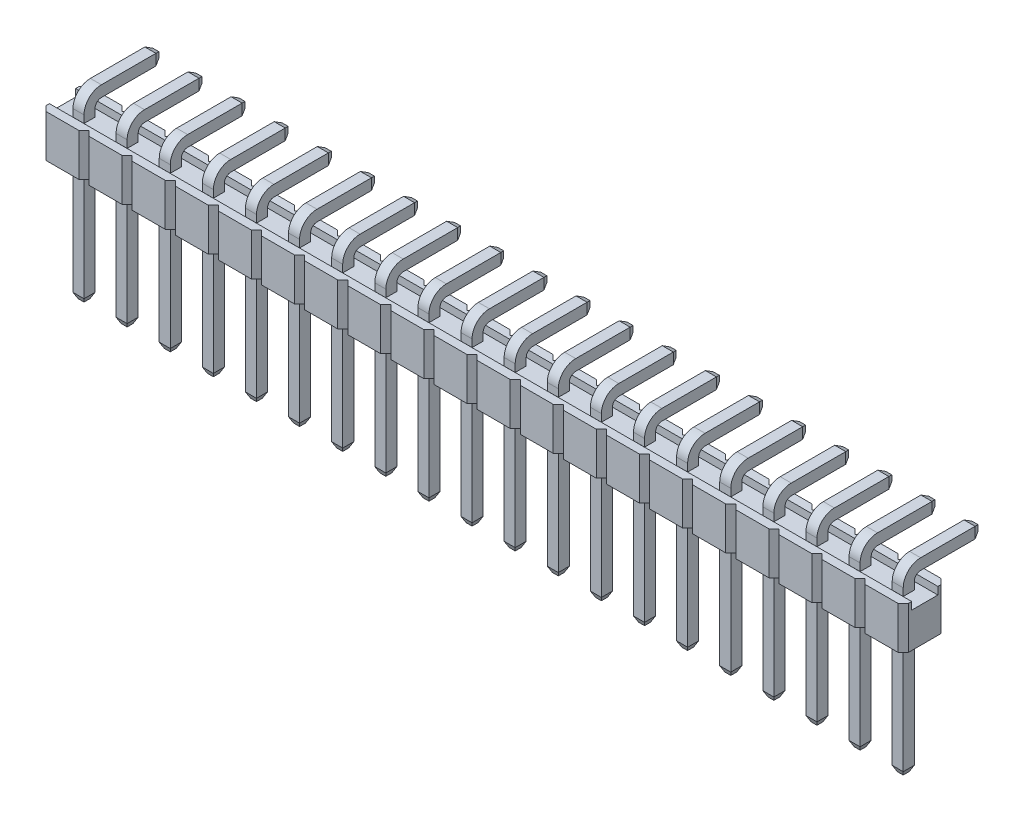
from build123d import *
from OCP.BRepFilletAPI import BRepFilletAPI_MakeChamfer

# Parameters (mm, degrees)
BASE_DEPTH                  = 2.5
LPATTERN1_COUNT             = 20
LPATTERN1_PITCH             = 2.54
CUT_DEPTH                   = 50.609311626
CUT_DEPTH_BACK              = 50.609311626
SKETCH2_W                   = 1.54
SKETCH2_H                   = 0.44
PIN_DEPTH                   = 0.325
CHAMFER1_SIZE               = 0.15
CHAMFER1_SIZE2              = 0.321676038
LPATTERN2_COUNT             = 20
LPATTERN2_PITCH             = 2.54
CHAMFER1_OF_LPATTERN2_SIZE  = 0.15
CHAMFER1_OF_LPATTERN2_SIZE2 = 0.321676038


with BuildPart() as part:
    # Sketch1 → Base (new body)
    with BuildSketch(Plane(origin=(0, 0, 0), x_dir=(1, 0, 0), z_dir=(0, 1, 0))):
        Polygon((-1.27, 0.97), (-0.97, 1.27), (0.97, 1.27), (1.27, 0.97), (1.27, -0.97), (0.97, -1.27), (-0.97, -1.27), (-1.27, -0.97), align=None)
    base = extrude(amount=-BASE_DEPTH)

    # LPattern1: Base ×20
    with Locations(*[(-i * LPATTERN1_PITCH, 0, 0) for i in range(1, LPATTERN1_COUNT)]):
        add(base)

    # Sketch2 → Cut (cut, two sides: drawn at the far end of the back side and taken through both)
    with BuildSketch(Plane(origin=(0, 0, 0), x_dir=(0, 0, -1), z_dir=(1, 0, 0)).offset(-CUT_DEPTH_BACK)):
        with Locations((0, -0.22)):
            Rectangle(SKETCH2_W, SKETCH2_H)
    extrude(amount=CUT_DEPTH + CUT_DEPTH_BACK, mode=Mode.SUBTRACT)

    # Sketch3 → Pin (add, symmetric)
    with BuildSketch(Plane(origin=(0, 0, 0), x_dir=(0, 0, -1), z_dir=(1, 0, 0))):
        with BuildLine():
            Line((0.325, -9.7), (0.325, 0))
            ThreePointArc((0.325, 0), (0.434834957, 0.265165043), (0.7, 0.375))
            Line((0.7, 0.375), (4.23, 0.375))
            Line((4.23, 0.375), (4.23, 1.025))
            Line((4.23, 1.025), (0.7, 1.025))
            ThreePointArc((0.7, 1.025), (-0.024784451, 0.724784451), (-0.325, 0))
            Line((-0.325, 0), (-0.325, -9.7))
            Line((-0.325, -9.7), (0.325, -9.7))
        make_face()
    pin = extrude(amount=PIN_DEPTH, both=True)

    # Chamfer1: one chamfer whose edges measure the first distance from different faces: ONE call of the kernel's chamfer builder (chamfer() names one face for all edges)
    chamfer1_edges_1 = [part.edges().sort_by_distance(p)[0] for p in [
        (-0.325, 0.7, -4.23),
        (0.325, 0.7, -4.23),
        (0, 0.375, -4.23),
        (0, 1.025, -4.23),
    ]]
    chamfer1_side_1 = [part.faces().sort_by_distance(p)[0] for p in [
        (0, 0.7, -4.23),
    ]]
    chamfer1_edges_2 = [part.edges().sort_by_distance(p)[0] for p in [
        (0.325, -9.7, 0),
        (0, -9.7, 0.325),
        (0, -9.7, -0.325),
        (-0.325, -9.7, 0),
    ]]
    chamfer1_side_2 = [part.faces().sort_by_distance(p)[0] for p in [
        (0, -9.7, 0),
    ]]
    chamfer1 = BRepFilletAPI_MakeChamfer(part.part.solid().wrapped)
    for e in chamfer1_edges_1:
        chamfer1.Add(CHAMFER1_SIZE, CHAMFER1_SIZE2, e.wrapped, chamfer1_side_1[0].wrapped)  # the first distance lies on this face
    for e in chamfer1_edges_2:
        chamfer1.Add(CHAMFER1_SIZE, CHAMFER1_SIZE2, e.wrapped, chamfer1_side_2[0].wrapped)  # the first distance lies on this face
    add(Compound.cast(chamfer1.Shape()), mode=Mode.REPLACE)

    # LPattern2: Pin ×20
    with Locations(*[(-i * LPATTERN2_PITCH, 0, 0) for i in range(1, LPATTERN2_COUNT)]):
        add(pin)

    # Chamfer1 of LPattern2: one chamfer whose edges measure the first distance from different faces: ONE call of the kernel's chamfer builder (chamfer() names one face for all edges)
    chamfer1_of_lpattern2_edges_1 = [part.edges().sort_by_distance(p)[0] for p in [
        (-2.865, 0.7, -4.23),
        (-2.215, 0.7, -4.23),
        (-2.54, 0.375, -4.23),
        (-2.54, 1.025, -4.23),
    ]]
    chamfer1_of_lpattern2_side_1 = [part.faces().sort_by_distance(p)[0] for p in [
        (-2.54, 0.7, -4.23),
    ]]
    chamfer1_of_lpattern2_edges_2 = [part.edges().sort_by_distance(p)[0] for p in [
        (-2.215, -9.7, 0),
        (-2.54, -9.7, 0.325),
        (-2.54, -9.7, -0.325),
        (-2.865, -9.7, 0),
    ]]
    chamfer1_of_lpattern2_side_2 = [part.faces().sort_by_distance(p)[0] for p in [
        (-2.54, -9.7, 0),
    ]]
    chamfer1_of_lpattern2_edges_3 = [part.edges().sort_by_distance(p)[0] for p in [
        (-5.405, 0.7, -4.23),
        (-4.755, 0.7, -4.23),
        (-5.08, 0.375, -4.23),
        (-5.08, 1.025, -4.23),
    ]]
    chamfer1_of_lpattern2_side_3 = [part.faces().sort_by_distance(p)[0] for p in [
        (-5.08, 0.7, -4.23),
    ]]
    chamfer1_of_lpattern2_edges_4 = [part.edges().sort_by_distance(p)[0] for p in [
        (-4.755, -9.7, 0),
        (-5.08, -9.7, 0.325),
        (-5.08, -9.7, -0.325),
        (-5.405, -9.7, 0),
    ]]
    chamfer1_of_lpattern2_side_4 = [part.faces().sort_by_distance(p)[0] for p in [
        (-5.08, -9.7, 0),
    ]]
    chamfer1_of_lpattern2_edges_5 = [part.edges().sort_by_distance(p)[0] for p in [
        (-7.945, 0.7, -4.23),
        (-7.295, 0.7, -4.23),
        (-7.62, 0.375, -4.23),
        (-7.62, 1.025, -4.23),
    ]]
    chamfer1_of_lpattern2_side_5 = [part.faces().sort_by_distance(p)[0] for p in [
        (-7.62, 0.7, -4.23),
    ]]
    chamfer1_of_lpattern2_edges_6 = [part.edges().sort_by_distance(p)[0] for p in [
        (-7.295, -9.7, 0),
        (-7.62, -9.7, 0.325),
        (-7.62, -9.7, -0.325),
        (-7.945, -9.7, 0),
    ]]
    chamfer1_of_lpattern2_side_6 = [part.faces().sort_by_distance(p)[0] for p in [
        (-7.62, -9.7, 0),
    ]]
    chamfer1_of_lpattern2_edges_7 = [part.edges().sort_by_distance(p)[0] for p in [
        (-10.485, 0.7, -4.23),
        (-9.835, 0.7, -4.23),
        (-10.16, 0.375, -4.23),
        (-10.16, 1.025, -4.23),
    ]]
    chamfer1_of_lpattern2_side_7 = [part.faces().sort_by_distance(p)[0] for p in [
        (-10.16, 0.7, -4.23),
    ]]
    chamfer1_of_lpattern2_edges_8 = [part.edges().sort_by_distance(p)[0] for p in [
        (-9.835, -9.7, 0),
        (-10.16, -9.7, 0.325),
        (-10.16, -9.7, -0.325),
        (-10.485, -9.7, 0),
    ]]
    chamfer1_of_lpattern2_side_8 = [part.faces().sort_by_distance(p)[0] for p in [
        (-10.16, -9.7, 0),
    ]]
    chamfer1_of_lpattern2_edges_9 = [part.edges().sort_by_distance(p)[0] for p in [
        (-13.025, 0.7, -4.23),
        (-12.375, 0.7, -4.23),
        (-12.7, 0.375, -4.23),
        (-12.7, 1.025, -4.23),
    ]]
    chamfer1_of_lpattern2_side_9 = [part.faces().sort_by_distance(p)[0] for p in [
        (-12.7, 0.7, -4.23),
    ]]
    chamfer1_of_lpattern2_edges_10 = [part.edges().sort_by_distance(p)[0] for p in [
        (-12.375, -9.7, 0),
        (-12.7, -9.7, 0.325),
        (-12.7, -9.7, -0.325),
        (-13.025, -9.7, 0),
    ]]
    chamfer1_of_lpattern2_side_10 = [part.faces().sort_by_distance(p)[0] for p in [
        (-12.7, -9.7, 0),
    ]]
    chamfer1_of_lpattern2_edges_11 = [part.edges().sort_by_distance(p)[0] for p in [
        (-15.565, 0.7, -4.23),
        (-14.915, 0.7, -4.23),
        (-15.24, 0.375, -4.23),
        (-15.24, 1.025, -4.23),
    ]]
    chamfer1_of_lpattern2_side_11 = [part.faces().sort_by_distance(p)[0] for p in [
        (-15.24, 0.7, -4.23),
    ]]
    chamfer1_of_lpattern2_edges_12 = [part.edges().sort_by_distance(p)[0] for p in [
        (-14.915, -9.7, 0),
        (-15.24, -9.7, 0.325),
        (-15.24, -9.7, -0.325),
        (-15.565, -9.7, 0),
    ]]
    chamfer1_of_lpattern2_side_12 = [part.faces().sort_by_distance(p)[0] for p in [
        (-15.24, -9.7, 0),
    ]]
    chamfer1_of_lpattern2_edges_13 = [part.edges().sort_by_distance(p)[0] for p in [
        (-18.105, 0.7, -4.23),
        (-17.455, 0.7, -4.23),
        (-17.78, 0.375, -4.23),
        (-17.78, 1.025, -4.23),
    ]]
    chamfer1_of_lpattern2_side_13 = [part.faces().sort_by_distance(p)[0] for p in [
        (-17.78, 0.7, -4.23),
    ]]
    chamfer1_of_lpattern2_edges_14 = [part.edges().sort_by_distance(p)[0] for p in [
        (-17.455, -9.7, 0),
        (-17.78, -9.7, 0.325),
        (-17.78, -9.7, -0.325),
        (-18.105, -9.7, 0),
    ]]
    chamfer1_of_lpattern2_side_14 = [part.faces().sort_by_distance(p)[0] for p in [
        (-17.78, -9.7, 0),
    ]]
    chamfer1_of_lpattern2_edges_15 = [part.edges().sort_by_distance(p)[0] for p in [
        (-20.645, 0.7, -4.23),
        (-19.995, 0.7, -4.23),
        (-20.32, 0.375, -4.23),
        (-20.32, 1.025, -4.23),
    ]]
    chamfer1_of_lpattern2_side_15 = [part.faces().sort_by_distance(p)[0] for p in [
        (-20.32, 0.7, -4.23),
    ]]
    chamfer1_of_lpattern2_edges_16 = [part.edges().sort_by_distance(p)[0] for p in [
        (-19.995, -9.7, 0),
        (-20.32, -9.7, 0.325),
        (-20.32, -9.7, -0.325),
        (-20.645, -9.7, 0),
    ]]
    chamfer1_of_lpattern2_side_16 = [part.faces().sort_by_distance(p)[0] for p in [
        (-20.32, -9.7, 0),
    ]]
    chamfer1_of_lpattern2_edges_17 = [part.edges().sort_by_distance(p)[0] for p in [
        (-23.185, 0.7, -4.23),
        (-22.535, 0.7, -4.23),
        (-22.86, 0.375, -4.23),
        (-22.86, 1.025, -4.23),
    ]]
    chamfer1_of_lpattern2_side_17 = [part.faces().sort_by_distance(p)[0] for p in [
        (-22.86, 0.7, -4.23),
    ]]
    chamfer1_of_lpattern2_edges_18 = [part.edges().sort_by_distance(p)[0] for p in [
        (-22.535, -9.7, 0),
        (-22.86, -9.7, 0.325),
        (-22.86, -9.7, -0.325),
        (-23.185, -9.7, 0),
    ]]
    chamfer1_of_lpattern2_side_18 = [part.faces().sort_by_distance(p)[0] for p in [
        (-22.86, -9.7, 0),
    ]]
    chamfer1_of_lpattern2_edges_19 = [part.edges().sort_by_distance(p)[0] for p in [
        (-25.725, 0.7, -4.23),
        (-25.075, 0.7, -4.23),
        (-25.4, 0.375, -4.23),
        (-25.4, 1.025, -4.23),
    ]]
    chamfer1_of_lpattern2_side_19 = [part.faces().sort_by_distance(p)[0] for p in [
        (-25.4, 0.7, -4.23),
    ]]
    chamfer1_of_lpattern2_edges_20 = [part.edges().sort_by_distance(p)[0] for p in [
        (-25.075, -9.7, 0),
        (-25.4, -9.7, 0.325),
        (-25.4, -9.7, -0.325),
        (-25.725, -9.7, 0),
    ]]
    chamfer1_of_lpattern2_side_20 = [part.faces().sort_by_distance(p)[0] for p in [
        (-25.4, -9.7, 0),
    ]]
    chamfer1_of_lpattern2_edges_21 = [part.edges().sort_by_distance(p)[0] for p in [
        (-28.265, 0.7, -4.23),
        (-27.615, 0.7, -4.23),
        (-27.94, 0.375, -4.23),
        (-27.94, 1.025, -4.23),
    ]]
    chamfer1_of_lpattern2_side_21 = [part.faces().sort_by_distance(p)[0] for p in [
        (-27.94, 0.7, -4.23),
    ]]
    chamfer1_of_lpattern2_edges_22 = [part.edges().sort_by_distance(p)[0] for p in [
        (-27.615, -9.7, 0),
        (-27.94, -9.7, 0.325),
        (-27.94, -9.7, -0.325),
        (-28.265, -9.7, 0),
    ]]
    chamfer1_of_lpattern2_side_22 = [part.faces().sort_by_distance(p)[0] for p in [
        (-27.94, -9.7, 0),
    ]]
    chamfer1_of_lpattern2_edges_23 = [part.edges().sort_by_distance(p)[0] for p in [
        (-30.805, 0.7, -4.23),
        (-30.155, 0.7, -4.23),
        (-30.48, 0.375, -4.23),
        (-30.48, 1.025, -4.23),
    ]]
    chamfer1_of_lpattern2_side_23 = [part.faces().sort_by_distance(p)[0] for p in [
        (-30.48, 0.7, -4.23),
    ]]
    chamfer1_of_lpattern2_edges_24 = [part.edges().sort_by_distance(p)[0] for p in [
        (-30.155, -9.7, 0),
        (-30.48, -9.7, 0.325),
        (-30.48, -9.7, -0.325),
        (-30.805, -9.7, 0),
    ]]
    chamfer1_of_lpattern2_side_24 = [part.faces().sort_by_distance(p)[0] for p in [
        (-30.48, -9.7, 0),
    ]]
    chamfer1_of_lpattern2_edges_25 = [part.edges().sort_by_distance(p)[0] for p in [
        (-33.345, 0.7, -4.23),
        (-32.695, 0.7, -4.23),
        (-33.02, 0.375, -4.23),
        (-33.02, 1.025, -4.23),
    ]]
    chamfer1_of_lpattern2_side_25 = [part.faces().sort_by_distance(p)[0] for p in [
        (-33.02, 0.7, -4.23),
    ]]
    chamfer1_of_lpattern2_edges_26 = [part.edges().sort_by_distance(p)[0] for p in [
        (-32.695, -9.7, 0),
        (-33.02, -9.7, 0.325),
        (-33.02, -9.7, -0.325),
        (-33.345, -9.7, 0),
    ]]
    chamfer1_of_lpattern2_side_26 = [part.faces().sort_by_distance(p)[0] for p in [
        (-33.02, -9.7, 0),
    ]]
    chamfer1_of_lpattern2_edges_27 = [part.edges().sort_by_distance(p)[0] for p in [
        (-35.885, 0.7, -4.23),
        (-35.235, 0.7, -4.23),
        (-35.56, 0.375, -4.23),
        (-35.56, 1.025, -4.23),
    ]]
    chamfer1_of_lpattern2_side_27 = [part.faces().sort_by_distance(p)[0] for p in [
        (-35.56, 0.7, -4.23),
    ]]
    chamfer1_of_lpattern2_edges_28 = [part.edges().sort_by_distance(p)[0] for p in [
        (-35.235, -9.7, 0),
        (-35.56, -9.7, 0.325),
        (-35.56, -9.7, -0.325),
        (-35.885, -9.7, 0),
    ]]
    chamfer1_of_lpattern2_side_28 = [part.faces().sort_by_distance(p)[0] for p in [
        (-35.56, -9.7, 0),
    ]]
    chamfer1_of_lpattern2_edges_29 = [part.edges().sort_by_distance(p)[0] for p in [
        (-38.425, 0.7, -4.23),
        (-37.775, 0.7, -4.23),
        (-38.1, 0.375, -4.23),
        (-38.1, 1.025, -4.23),
    ]]
    chamfer1_of_lpattern2_side_29 = [part.faces().sort_by_distance(p)[0] for p in [
        (-38.1, 0.7, -4.23),
    ]]
    chamfer1_of_lpattern2_edges_30 = [part.edges().sort_by_distance(p)[0] for p in [
        (-37.775, -9.7, 0),
        (-38.1, -9.7, 0.325),
        (-38.1, -9.7, -0.325),
        (-38.425, -9.7, 0),
    ]]
    chamfer1_of_lpattern2_side_30 = [part.faces().sort_by_distance(p)[0] for p in [
        (-38.1, -9.7, 0),
    ]]
    chamfer1_of_lpattern2_edges_31 = [part.edges().sort_by_distance(p)[0] for p in [
        (-40.965, 0.7, -4.23),
        (-40.315, 0.7, -4.23),
        (-40.64, 0.375, -4.23),
        (-40.64, 1.025, -4.23),
    ]]
    chamfer1_of_lpattern2_side_31 = [part.faces().sort_by_distance(p)[0] for p in [
        (-40.64, 0.7, -4.23),
    ]]
    chamfer1_of_lpattern2_edges_32 = [part.edges().sort_by_distance(p)[0] for p in [
        (-40.315, -9.7, 0),
        (-40.64, -9.7, 0.325),
        (-40.64, -9.7, -0.325),
        (-40.965, -9.7, 0),
    ]]
    chamfer1_of_lpattern2_side_32 = [part.faces().sort_by_distance(p)[0] for p in [
        (-40.64, -9.7, 0),
    ]]
    chamfer1_of_lpattern2_edges_33 = [part.edges().sort_by_distance(p)[0] for p in [
        (-43.505, 0.7, -4.23),
        (-42.855, 0.7, -4.23),
        (-43.18, 0.375, -4.23),
        (-43.18, 1.025, -4.23),
    ]]
    chamfer1_of_lpattern2_side_33 = [part.faces().sort_by_distance(p)[0] for p in [
        (-43.18, 0.7, -4.23),
    ]]
    chamfer1_of_lpattern2_edges_34 = [part.edges().sort_by_distance(p)[0] for p in [
        (-42.855, -9.7, 0),
        (-43.18, -9.7, 0.325),
        (-43.18, -9.7, -0.325),
        (-43.505, -9.7, 0),
    ]]
    chamfer1_of_lpattern2_side_34 = [part.faces().sort_by_distance(p)[0] for p in [
        (-43.18, -9.7, 0),
    ]]
    chamfer1_of_lpattern2_edges_35 = [part.edges().sort_by_distance(p)[0] for p in [
        (-46.045, 0.7, -4.23),
        (-45.395, 0.7, -4.23),
        (-45.72, 0.375, -4.23),
        (-45.72, 1.025, -4.23),
    ]]
    chamfer1_of_lpattern2_side_35 = [part.faces().sort_by_distance(p)[0] for p in [
        (-45.72, 0.7, -4.23),
    ]]
    chamfer1_of_lpattern2_edges_36 = [part.edges().sort_by_distance(p)[0] for p in [
        (-45.395, -9.7, 0),
        (-45.72, -9.7, 0.325),
        (-45.72, -9.7, -0.325),
        (-46.045, -9.7, 0),
    ]]
    chamfer1_of_lpattern2_side_36 = [part.faces().sort_by_distance(p)[0] for p in [
        (-45.72, -9.7, 0),
    ]]
    chamfer1_of_lpattern2_edges_37 = [part.edges().sort_by_distance(p)[0] for p in [
        (-48.585, 0.7, -4.23),
        (-47.935, 0.7, -4.23),
        (-48.26, 0.375, -4.23),
        (-48.26, 1.025, -4.23),
    ]]
    chamfer1_of_lpattern2_side_37 = [part.faces().sort_by_distance(p)[0] for p in [
        (-48.26, 0.7, -4.23),
    ]]
    chamfer1_of_lpattern2_edges_38 = [part.edges().sort_by_distance(p)[0] for p in [
        (-47.935, -9.7, 0),
        (-48.26, -9.7, 0.325),
        (-48.26, -9.7, -0.325),
        (-48.585, -9.7, 0),
    ]]
    chamfer1_of_lpattern2_side_38 = [part.faces().sort_by_distance(p)[0] for p in [
        (-48.26, -9.7, 0),
    ]]
    chamfer1_of_lpattern2 = BRepFilletAPI_MakeChamfer(part.part.solid().wrapped)
    for e in chamfer1_of_lpattern2_edges_1:
        chamfer1_of_lpattern2.Add(CHAMFER1_OF_LPATTERN2_SIZE, CHAMFER1_OF_LPATTERN2_SIZE2, e.wrapped, chamfer1_of_lpattern2_side_1[0].wrapped)  # the first distance lies on this face
    for e in chamfer1_of_lpattern2_edges_2:
        chamfer1_of_lpattern2.Add(CHAMFER1_OF_LPATTERN2_SIZE, CHAMFER1_OF_LPATTERN2_SIZE2, e.wrapped, chamfer1_of_lpattern2_side_2[0].wrapped)  # the first distance lies on this face
    for e in chamfer1_of_lpattern2_edges_3:
        chamfer1_of_lpattern2.Add(CHAMFER1_OF_LPATTERN2_SIZE, CHAMFER1_OF_LPATTERN2_SIZE2, e.wrapped, chamfer1_of_lpattern2_side_3[0].wrapped)  # the first distance lies on this face
    for e in chamfer1_of_lpattern2_edges_4:
        chamfer1_of_lpattern2.Add(CHAMFER1_OF_LPATTERN2_SIZE, CHAMFER1_OF_LPATTERN2_SIZE2, e.wrapped, chamfer1_of_lpattern2_side_4[0].wrapped)  # the first distance lies on this face
    for e in chamfer1_of_lpattern2_edges_5:
        chamfer1_of_lpattern2.Add(CHAMFER1_OF_LPATTERN2_SIZE, CHAMFER1_OF_LPATTERN2_SIZE2, e.wrapped, chamfer1_of_lpattern2_side_5[0].wrapped)  # the first distance lies on this face
    for e in chamfer1_of_lpattern2_edges_6:
        chamfer1_of_lpattern2.Add(CHAMFER1_OF_LPATTERN2_SIZE, CHAMFER1_OF_LPATTERN2_SIZE2, e.wrapped, chamfer1_of_lpattern2_side_6[0].wrapped)  # the first distance lies on this face
    for e in chamfer1_of_lpattern2_edges_7:
        chamfer1_of_lpattern2.Add(CHAMFER1_OF_LPATTERN2_SIZE, CHAMFER1_OF_LPATTERN2_SIZE2, e.wrapped, chamfer1_of_lpattern2_side_7[0].wrapped)  # the first distance lies on this face
    for e in chamfer1_of_lpattern2_edges_8:
        chamfer1_of_lpattern2.Add(CHAMFER1_OF_LPATTERN2_SIZE, CHAMFER1_OF_LPATTERN2_SIZE2, e.wrapped, chamfer1_of_lpattern2_side_8[0].wrapped)  # the first distance lies on this face
    for e in chamfer1_of_lpattern2_edges_9:
        chamfer1_of_lpattern2.Add(CHAMFER1_OF_LPATTERN2_SIZE, CHAMFER1_OF_LPATTERN2_SIZE2, e.wrapped, chamfer1_of_lpattern2_side_9[0].wrapped)  # the first distance lies on this face
    for e in chamfer1_of_lpattern2_edges_10:
        chamfer1_of_lpattern2.Add(CHAMFER1_OF_LPATTERN2_SIZE, CHAMFER1_OF_LPATTERN2_SIZE2, e.wrapped, chamfer1_of_lpattern2_side_10[0].wrapped)  # the first distance lies on this face
    for e in chamfer1_of_lpattern2_edges_11:
        chamfer1_of_lpattern2.Add(CHAMFER1_OF_LPATTERN2_SIZE, CHAMFER1_OF_LPATTERN2_SIZE2, e.wrapped, chamfer1_of_lpattern2_side_11[0].wrapped)  # the first distance lies on this face
    for e in chamfer1_of_lpattern2_edges_12:
        chamfer1_of_lpattern2.Add(CHAMFER1_OF_LPATTERN2_SIZE, CHAMFER1_OF_LPATTERN2_SIZE2, e.wrapped, chamfer1_of_lpattern2_side_12[0].wrapped)  # the first distance lies on this face
    for e in chamfer1_of_lpattern2_edges_13:
        chamfer1_of_lpattern2.Add(CHAMFER1_OF_LPATTERN2_SIZE, CHAMFER1_OF_LPATTERN2_SIZE2, e.wrapped, chamfer1_of_lpattern2_side_13[0].wrapped)  # the first distance lies on this face
    for e in chamfer1_of_lpattern2_edges_14:
        chamfer1_of_lpattern2.Add(CHAMFER1_OF_LPATTERN2_SIZE, CHAMFER1_OF_LPATTERN2_SIZE2, e.wrapped, chamfer1_of_lpattern2_side_14[0].wrapped)  # the first distance lies on this face
    for e in chamfer1_of_lpattern2_edges_15:
        chamfer1_of_lpattern2.Add(CHAMFER1_OF_LPATTERN2_SIZE, CHAMFER1_OF_LPATTERN2_SIZE2, e.wrapped, chamfer1_of_lpattern2_side_15[0].wrapped)  # the first distance lies on this face
    for e in chamfer1_of_lpattern2_edges_16:
        chamfer1_of_lpattern2.Add(CHAMFER1_OF_LPATTERN2_SIZE, CHAMFER1_OF_LPATTERN2_SIZE2, e.wrapped, chamfer1_of_lpattern2_side_16[0].wrapped)  # the first distance lies on this face
    for e in chamfer1_of_lpattern2_edges_17:
        chamfer1_of_lpattern2.Add(CHAMFER1_OF_LPATTERN2_SIZE, CHAMFER1_OF_LPATTERN2_SIZE2, e.wrapped, chamfer1_of_lpattern2_side_17[0].wrapped)  # the first distance lies on this face
    for e in chamfer1_of_lpattern2_edges_18:
        chamfer1_of_lpattern2.Add(CHAMFER1_OF_LPATTERN2_SIZE, CHAMFER1_OF_LPATTERN2_SIZE2, e.wrapped, chamfer1_of_lpattern2_side_18[0].wrapped)  # the first distance lies on this face
    for e in chamfer1_of_lpattern2_edges_19:
        chamfer1_of_lpattern2.Add(CHAMFER1_OF_LPATTERN2_SIZE, CHAMFER1_OF_LPATTERN2_SIZE2, e.wrapped, chamfer1_of_lpattern2_side_19[0].wrapped)  # the first distance lies on this face
    for e in chamfer1_of_lpattern2_edges_20:
        chamfer1_of_lpattern2.Add(CHAMFER1_OF_LPATTERN2_SIZE, CHAMFER1_OF_LPATTERN2_SIZE2, e.wrapped, chamfer1_of_lpattern2_side_20[0].wrapped)  # the first distance lies on this face
    for e in chamfer1_of_lpattern2_edges_21:
        chamfer1_of_lpattern2.Add(CHAMFER1_OF_LPATTERN2_SIZE, CHAMFER1_OF_LPATTERN2_SIZE2, e.wrapped, chamfer1_of_lpattern2_side_21[0].wrapped)  # the first distance lies on this face
    for e in chamfer1_of_lpattern2_edges_22:
        chamfer1_of_lpattern2.Add(CHAMFER1_OF_LPATTERN2_SIZE, CHAMFER1_OF_LPATTERN2_SIZE2, e.wrapped, chamfer1_of_lpattern2_side_22[0].wrapped)  # the first distance lies on this face
    for e in chamfer1_of_lpattern2_edges_23:
        chamfer1_of_lpattern2.Add(CHAMFER1_OF_LPATTERN2_SIZE, CHAMFER1_OF_LPATTERN2_SIZE2, e.wrapped, chamfer1_of_lpattern2_side_23[0].wrapped)  # the first distance lies on this face
    for e in chamfer1_of_lpattern2_edges_24:
        chamfer1_of_lpattern2.Add(CHAMFER1_OF_LPATTERN2_SIZE, CHAMFER1_OF_LPATTERN2_SIZE2, e.wrapped, chamfer1_of_lpattern2_side_24[0].wrapped)  # the first distance lies on this face
    for e in chamfer1_of_lpattern2_edges_25:
        chamfer1_of_lpattern2.Add(CHAMFER1_OF_LPATTERN2_SIZE, CHAMFER1_OF_LPATTERN2_SIZE2, e.wrapped, chamfer1_of_lpattern2_side_25[0].wrapped)  # the first distance lies on this face
    for e in chamfer1_of_lpattern2_edges_26:
        chamfer1_of_lpattern2.Add(CHAMFER1_OF_LPATTERN2_SIZE, CHAMFER1_OF_LPATTERN2_SIZE2, e.wrapped, chamfer1_of_lpattern2_side_26[0].wrapped)  # the first distance lies on this face
    for e in chamfer1_of_lpattern2_edges_27:
        chamfer1_of_lpattern2.Add(CHAMFER1_OF_LPATTERN2_SIZE, CHAMFER1_OF_LPATTERN2_SIZE2, e.wrapped, chamfer1_of_lpattern2_side_27[0].wrapped)  # the first distance lies on this face
    for e in chamfer1_of_lpattern2_edges_28:
        chamfer1_of_lpattern2.Add(CHAMFER1_OF_LPATTERN2_SIZE, CHAMFER1_OF_LPATTERN2_SIZE2, e.wrapped, chamfer1_of_lpattern2_side_28[0].wrapped)  # the first distance lies on this face
    for e in chamfer1_of_lpattern2_edges_29:
        chamfer1_of_lpattern2.Add(CHAMFER1_OF_LPATTERN2_SIZE, CHAMFER1_OF_LPATTERN2_SIZE2, e.wrapped, chamfer1_of_lpattern2_side_29[0].wrapped)  # the first distance lies on this face
    for e in chamfer1_of_lpattern2_edges_30:
        chamfer1_of_lpattern2.Add(CHAMFER1_OF_LPATTERN2_SIZE, CHAMFER1_OF_LPATTERN2_SIZE2, e.wrapped, chamfer1_of_lpattern2_side_30[0].wrapped)  # the first distance lies on this face
    for e in chamfer1_of_lpattern2_edges_31:
        chamfer1_of_lpattern2.Add(CHAMFER1_OF_LPATTERN2_SIZE, CHAMFER1_OF_LPATTERN2_SIZE2, e.wrapped, chamfer1_of_lpattern2_side_31[0].wrapped)  # the first distance lies on this face
    for e in chamfer1_of_lpattern2_edges_32:
        chamfer1_of_lpattern2.Add(CHAMFER1_OF_LPATTERN2_SIZE, CHAMFER1_OF_LPATTERN2_SIZE2, e.wrapped, chamfer1_of_lpattern2_side_32[0].wrapped)  # the first distance lies on this face
    for e in chamfer1_of_lpattern2_edges_33:
        chamfer1_of_lpattern2.Add(CHAMFER1_OF_LPATTERN2_SIZE, CHAMFER1_OF_LPATTERN2_SIZE2, e.wrapped, chamfer1_of_lpattern2_side_33[0].wrapped)  # the first distance lies on this face
    for e in chamfer1_of_lpattern2_edges_34:
        chamfer1_of_lpattern2.Add(CHAMFER1_OF_LPATTERN2_SIZE, CHAMFER1_OF_LPATTERN2_SIZE2, e.wrapped, chamfer1_of_lpattern2_side_34[0].wrapped)  # the first distance lies on this face
    for e in chamfer1_of_lpattern2_edges_35:
        chamfer1_of_lpattern2.Add(CHAMFER1_OF_LPATTERN2_SIZE, CHAMFER1_OF_LPATTERN2_SIZE2, e.wrapped, chamfer1_of_lpattern2_side_35[0].wrapped)  # the first distance lies on this face
    for e in chamfer1_of_lpattern2_edges_36:
        chamfer1_of_lpattern2.Add(CHAMFER1_OF_LPATTERN2_SIZE, CHAMFER1_OF_LPATTERN2_SIZE2, e.wrapped, chamfer1_of_lpattern2_side_36[0].wrapped)  # the first distance lies on this face
    for e in chamfer1_of_lpattern2_edges_37:
        chamfer1_of_lpattern2.Add(CHAMFER1_OF_LPATTERN2_SIZE, CHAMFER1_OF_LPATTERN2_SIZE2, e.wrapped, chamfer1_of_lpattern2_side_37[0].wrapped)  # the first distance lies on this face
    for e in chamfer1_of_lpattern2_edges_38:
        chamfer1_of_lpattern2.Add(CHAMFER1_OF_LPATTERN2_SIZE, CHAMFER1_OF_LPATTERN2_SIZE2, e.wrapped, chamfer1_of_lpattern2_side_38[0].wrapped)  # the first distance lies on this face
    add(Compound.cast(chamfer1_of_lpattern2.Shape()), mode=Mode.REPLACE)


solid = part.part
